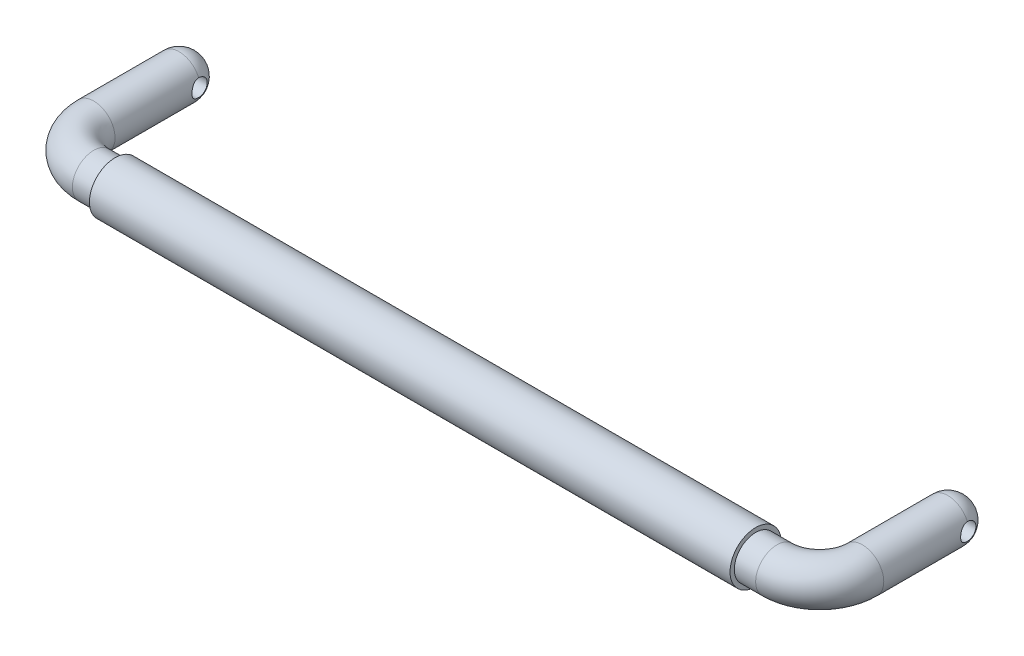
ISO-10303-21;
HEADER;
FILE_DESCRIPTION(('STEP AP214'),'2;1');
FILE_NAME('part.step','',(''),(''),'','','');
FILE_SCHEMA(('AUTOMOTIVE_DESIGN { 1 0 10303 214 1 1 1 1 }'));
ENDSEC;
DATA;
#1=APPLICATION_CONTEXT('core data for automotive mechanical design processes');
#2=APPLICATION_PROTOCOL_DEFINITION('international standard','automotive_design',2000,#1);
#3=PRODUCT_CONTEXT('',#1,'mechanical');
#4=PRODUCT('Part','Part','',(#3));
#5=PRODUCT_RELATED_PRODUCT_CATEGORY('part','',(#4));
#6=PRODUCT_DEFINITION_FORMATION('','',#4);
#7=PRODUCT_DEFINITION_CONTEXT('part definition',#1,'design');
#8=PRODUCT_DEFINITION('design','',#6,#7);
#9=PRODUCT_DEFINITION_SHAPE('','',#8);
#10=(LENGTH_UNIT() NAMED_UNIT(*) SI_UNIT(.MILLI.,.METRE.));
#11=(NAMED_UNIT(*) PLANE_ANGLE_UNIT() SI_UNIT($,.RADIAN.));
#12=(NAMED_UNIT(*) SI_UNIT($,.STERADIAN.) SOLID_ANGLE_UNIT());
#13=UNCERTAINTY_MEASURE_WITH_UNIT(LENGTH_MEASURE(1.E-05),#10,'distance_accuracy_value','');
#14=(GEOMETRIC_REPRESENTATION_CONTEXT(3) GLOBAL_UNCERTAINTY_ASSIGNED_CONTEXT((#13)) GLOBAL_UNIT_ASSIGNED_CONTEXT((#10,
#11,#12)) REPRESENTATION_CONTEXT('',''));
#15=CARTESIAN_POINT('',(0.,0.,0.));
#16=DIRECTION('',(0.,0.,1.));
#17=DIRECTION('',(1.,0.,0.));
#18=AXIS2_PLACEMENT_3D('',#15,#16,#17);
#19=CARTESIAN_POINT('',(10.,0.,30.));
#20=DIRECTION('',(1.,0.,0.));
#21=DIRECTION('',(0.,0.,1.));
#22=AXIS2_PLACEMENT_3D('',#19,#20,#21);
#23=CYLINDRICAL_SURFACE('',#22,5.);
#24=CARTESIAN_POINT('',(15.,0.,30.));
#25=DIRECTION('',(-1.,0.,0.));
#26=DIRECTION('',(0.,-1.,0.));
#27=AXIS2_PLACEMENT_3D('',#24,#25,#26);
#28=CIRCLE('',#27,5.);
#29=CARTESIAN_POINT('',(15.,-5.,30.));
#30=VERTEX_POINT('',#29);
#31=EDGE_CURVE('E9',#30,#30,#28,.F.);
#32=ORIENTED_EDGE('',*,*,#31,.F.);
#33=EDGE_LOOP('',(#32));
#34=FACE_BOUND('',#33,.T.);
#35=CARTESIAN_POINT('',(10.,0.,30.));
#36=DIRECTION('',(1.,0.,0.));
#37=DIRECTION('',(0.,-1.,0.));
#38=AXIS2_PLACEMENT_3D('',#35,#36,#37);
#39=CIRCLE('',#38,5.);
#40=CARTESIAN_POINT('',(10.,0.,35.));
#41=VERTEX_POINT('',#40);
#42=EDGE_CURVE('E97',#41,#41,#39,.T.);
#43=ORIENTED_EDGE('',*,*,#42,.T.);
#44=EDGE_LOOP('',(#43));
#45=FACE_BOUND('',#44,.T.);
#46=ADVANCED_FACE('F14',(#34,#45),#23,.T.);
#47=CARTESIAN_POINT('',(10.,0.,20.));
#48=DIRECTION('',(0.,1.,0.));
#49=DIRECTION('',(-1.,0.,0.));
#50=AXIS2_PLACEMENT_3D('',#47,#48,#49);
#51=TOROIDAL_SURFACE('',#50,10.,5.);
#52=CARTESIAN_POINT('',(0.,0.,20.));
#53=DIRECTION('',(0.,0.,1.));
#54=DIRECTION('',(0.,-1.,0.));
#55=AXIS2_PLACEMENT_3D('',#52,#53,#54);
#56=CIRCLE('',#55,5.);
#57=CARTESIAN_POINT('',(-5.,0.,20.));
#58=VERTEX_POINT('',#57);
#59=EDGE_CURVE('E99',#58,#58,#56,.T.);
#60=CARTESIAN_POINT('',(10.,0.,20.));
#61=DIRECTION('',(0.,1.,0.));
#62=DIRECTION('',(-1.,0.,0.));
#63=AXIS2_PLACEMENT_3D('',#60,#61,#62);
#64=CIRCLE('',#63,15.);
#65=EDGE_CURVE('',#58,#41,#64,.T.);
#66=ORIENTED_EDGE('',*,*,#59,.T.);
#67=ORIENTED_EDGE('',*,*,#42,.F.);
#68=ORIENTED_EDGE('',*,*,#65,.T.);
#69=ORIENTED_EDGE('',*,*,#65,.F.);
#70=EDGE_LOOP('',(#66,#68,#67,#69));
#71=FACE_BOUND('',#70,.T.);
#72=ADVANCED_FACE('F164',(#71),#51,.T.);
#73=CARTESIAN_POINT('',(0.,0.,20.));
#74=DIRECTION('',(0.,0.,-1.));
#75=DIRECTION('',(0.,1.,0.));
#76=AXIS2_PLACEMENT_3D('',#73,#74,#75);
#77=CYLINDRICAL_SURFACE('',#76,5.);
#78=ORIENTED_EDGE('',*,*,#59,.F.);
#79=EDGE_LOOP('',(#78));
#80=FACE_BOUND('',#79,.T.);
#81=CARTESIAN_POINT('',(0.,0.,0.));
#82=DIRECTION('',(0.,0.,-1.));
#83=DIRECTION('',(0.,1.,0.));
#84=AXIS2_PLACEMENT_3D('',#81,#82,#83);
#85=CIRCLE('',#84,5.);
#86=CARTESIAN_POINT('',(-4.58257569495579,2.,0.));
#87=VERTEX_POINT('',#86);
#88=CARTESIAN_POINT('',(4.58257569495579,2.,0.));
#89=VERTEX_POINT('',#88);
#90=EDGE_CURVE('E105',#87,#89,#85,.T.);
#91=ORIENTED_EDGE('',*,*,#90,.F.);
#92=CARTESIAN_POINT('',(-4.58257569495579,2.,0.));
#93=CARTESIAN_POINT('',(-4.58256464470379,2.00000798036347,0.0538058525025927));
#94=CARTESIAN_POINT('',(-4.58352306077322,1.99782891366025,0.107605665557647));
#95=CARTESIAN_POINT('',(-4.58729625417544,1.98915905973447,0.214771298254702));
#96=CARTESIAN_POINT('',(-4.59011032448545,1.98266991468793,0.268137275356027));
#97=CARTESIAN_POINT('',(-4.59749782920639,1.9654760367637,0.373846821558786));
#98=CARTESIAN_POINT('',(-4.60206430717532,1.95478796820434,0.426193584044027));
#99=CARTESIAN_POINT('',(-4.61280053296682,1.9293163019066,0.529700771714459));
#100=CARTESIAN_POINT('',(-4.61897037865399,1.9145324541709,0.580861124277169));
#101=CARTESIAN_POINT('',(-4.63959291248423,1.86426971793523,0.731935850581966));
#102=CARTESIAN_POINT('',(-4.65617449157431,1.82284489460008,0.829654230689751));
#103=CARTESIAN_POINT('',(-4.69312370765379,1.72548191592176,1.01679558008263));
#104=CARTESIAN_POINT('',(-4.71349493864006,1.66952996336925,1.10621055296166));
#105=CARTESIAN_POINT('',(-4.75700999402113,1.54131835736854,1.27926239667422));
#106=CARTESIAN_POINT('',(-4.78024245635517,1.4683691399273,1.36236721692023));
#107=CARTESIAN_POINT('',(-4.82612790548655,1.30969646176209,1.51554027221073));
#108=CARTESIAN_POINT('',(-4.84878077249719,1.22397038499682,1.58560583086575));
#109=CARTESIAN_POINT('',(-4.8920341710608,1.03800590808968,1.71340639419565));
#110=CARTESIAN_POINT('',(-4.91251824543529,0.937327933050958,1.77054480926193));
#111=CARTESIAN_POINT('',(-4.94803944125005,0.726824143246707,1.86684407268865));
#112=CARTESIAN_POINT('',(-4.96307883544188,0.617002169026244,1.90601242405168));
#113=CARTESIAN_POINT('',(-4.98538314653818,0.396967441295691,1.96334120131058));
#114=CARTESIAN_POINT('',(-4.99298922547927,0.287031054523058,1.98242695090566));
#115=CARTESIAN_POINT('',(-5.00080310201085,0.0652684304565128,2.00202847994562));
#116=CARTESIAN_POINT('',(-5.00101352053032,-0.0465571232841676,2.00255083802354));
#117=CARTESIAN_POINT('',(-4.99421960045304,-0.262233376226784,1.98551716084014));
#118=CARTESIAN_POINT('',(-4.98761985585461,-0.36617920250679,1.968974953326));
#119=CARTESIAN_POINT('',(-4.96849270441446,-0.569674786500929,1.92000657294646));
#120=CARTESIAN_POINT('',(-4.95596496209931,-0.669224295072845,1.88757950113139));
#121=CARTESIAN_POINT('',(-4.92596830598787,-0.862897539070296,1.80736370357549));
#122=CARTESIAN_POINT('',(-4.90842774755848,-0.956916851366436,1.75935075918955));
#123=CARTESIAN_POINT('',(-4.87014602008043,-1.13580746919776,1.64953541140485));
#124=CARTESIAN_POINT('',(-4.84940372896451,-1.22067554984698,1.58772817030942));
#125=CARTESIAN_POINT('',(-4.80521782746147,-1.38476339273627,1.44735581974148));
#126=CARTESIAN_POINT('',(-4.78168627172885,-1.4632477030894,1.36795752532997));
#127=CARTESIAN_POINT('',(-4.73561950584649,-1.60609926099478,1.19701990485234));
#128=CARTESIAN_POINT('',(-4.71308475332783,-1.67046007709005,1.10547507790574));
#129=CARTESIAN_POINT('',(-4.67095688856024,-1.78493657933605,0.909529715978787));
#130=CARTESIAN_POINT('',(-4.65146702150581,-1.83458932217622,0.804835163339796));
#131=CARTESIAN_POINT('',(-4.61886105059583,-1.91521298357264,0.58763847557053));
#132=CARTESIAN_POINT('',(-4.60573367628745,-1.94621696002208,0.475150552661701));
#133=CARTESIAN_POINT('',(-4.59208303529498,-1.9781058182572,0.301256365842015));
#134=CARTESIAN_POINT('',(-4.58853437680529,-1.98630505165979,0.241342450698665));
#135=CARTESIAN_POINT('',(-4.58377540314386,-1.99725282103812,0.120964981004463));
#136=CARTESIAN_POINT('',(-4.5825636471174,-2.00000471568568,0.060501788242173));
#137=CARTESIAN_POINT('',(-4.58257569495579,-2.,0.));
#138=B_SPLINE_CURVE_WITH_KNOTS('',3,(#92,#93,#94,#95,#96,#97,#98,#99,#100,#101,#102,#103,#104,
#105,#106,#107,#108,#109,#110,#111,#112,#113,#114,#115,#116,#117,#118,#119,#120,#121,#122,#123,
#124,#125,#126,#127,#128,#129,#130,#131,#132,#133,#134,#135,#136,#137),.UNSPECIFIED.,.F.,.F.,(4,
2,2,2,2,2,2,2,2,2,2,2,2,2,2,2,2,2,2,2,2,2,4),(0.,0.161354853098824,0.322648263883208,
0.483307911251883,0.643977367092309,0.964683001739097,1.28569434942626,1.62318047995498,
1.96073580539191,2.31162858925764,2.66237473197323,2.9961387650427,3.32978451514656,
3.64468915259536,3.95961161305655,4.27928176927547,4.59906421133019,4.93981874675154,
5.28072813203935,5.63144241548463,5.98153315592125,6.16300192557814,6.34435877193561),.UNSPECIFIED.);
#139=CARTESIAN_POINT('',(-4.58257569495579,-2.,0.));
#140=VERTEX_POINT('',#139);
#141=EDGE_CURVE('E29',#87,#140,#138,.T.);
#142=ORIENTED_EDGE('',*,*,#141,.T.);
#143=CARTESIAN_POINT('',(4.58257569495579,-2.,0.));
#144=VERTEX_POINT('',#143);
#145=EDGE_CURVE('E104',#144,#140,#85,.T.);
#146=ORIENTED_EDGE('',*,*,#145,.F.);
#147=CARTESIAN_POINT('',(4.58257569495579,-2.,0.));
#148=CARTESIAN_POINT('',(4.5825646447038,-2.00000798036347,0.0538058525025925));
#149=CARTESIAN_POINT('',(4.58352306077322,-1.99782891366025,0.107605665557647));
#150=CARTESIAN_POINT('',(4.58729625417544,-1.98915905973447,0.214771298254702));
#151=CARTESIAN_POINT('',(4.59011032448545,-1.98266991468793,0.268137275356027));
#152=CARTESIAN_POINT('',(4.59749782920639,-1.9654760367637,0.373846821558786));
#153=CARTESIAN_POINT('',(4.60206430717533,-1.95478796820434,0.426193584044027));
#154=CARTESIAN_POINT('',(4.61280053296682,-1.9293163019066,0.529700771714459));
#155=CARTESIAN_POINT('',(4.61897037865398,-1.9145324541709,0.580861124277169));
#156=CARTESIAN_POINT('',(4.63959291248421,-1.86426971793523,0.731935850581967));
#157=CARTESIAN_POINT('',(4.65617449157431,-1.82284489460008,0.82965423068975));
#158=CARTESIAN_POINT('',(4.6931237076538,-1.72548191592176,1.01679558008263));
#159=CARTESIAN_POINT('',(4.71349493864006,-1.66952996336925,1.10621055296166));
#160=CARTESIAN_POINT('',(4.75700999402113,-1.54131835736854,1.27926239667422));
#161=CARTESIAN_POINT('',(4.78024245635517,-1.4683691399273,1.36236721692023));
#162=CARTESIAN_POINT('',(4.82612790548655,-1.30969646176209,1.51554027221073));
#163=CARTESIAN_POINT('',(4.84878077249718,-1.22397038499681,1.58560583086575));
#164=CARTESIAN_POINT('',(4.89203417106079,-1.03800590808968,1.71340639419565));
#165=CARTESIAN_POINT('',(4.91251824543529,-0.937327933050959,1.77054480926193));
#166=CARTESIAN_POINT('',(4.94803944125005,-0.726824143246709,1.86684407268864));
#167=CARTESIAN_POINT('',(4.96307883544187,-0.617002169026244,1.90601242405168));
#168=CARTESIAN_POINT('',(4.98538314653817,-0.39696744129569,1.96334120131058));
#169=CARTESIAN_POINT('',(4.99298922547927,-0.287031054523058,1.98242695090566));
#170=CARTESIAN_POINT('',(5.00080310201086,-0.065268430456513,2.00202847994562));
#171=CARTESIAN_POINT('',(5.00101352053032,0.0465571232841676,2.00255083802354));
#172=CARTESIAN_POINT('',(4.99421960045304,0.262233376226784,1.98551716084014));
#173=CARTESIAN_POINT('',(4.98761985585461,0.36617920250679,1.968974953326));
#174=CARTESIAN_POINT('',(4.96849270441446,0.569674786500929,1.92000657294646));
#175=CARTESIAN_POINT('',(4.95596496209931,0.669224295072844,1.88757950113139));
#176=CARTESIAN_POINT('',(4.92596830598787,0.862897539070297,1.80736370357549));
#177=CARTESIAN_POINT('',(4.90842774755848,0.956916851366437,1.75935075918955));
#178=CARTESIAN_POINT('',(4.87014602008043,1.13580746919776,1.64953541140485));
#179=CARTESIAN_POINT('',(4.8494037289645,1.22067554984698,1.58772817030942));
#180=CARTESIAN_POINT('',(4.80521782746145,1.38476339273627,1.44735581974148));
#181=CARTESIAN_POINT('',(4.78168627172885,1.4632477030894,1.36795752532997));
#182=CARTESIAN_POINT('',(4.73561950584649,1.60609926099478,1.19701990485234));
#183=CARTESIAN_POINT('',(4.71308475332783,1.67046007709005,1.10547507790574));
#184=CARTESIAN_POINT('',(4.67095688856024,1.78493657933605,0.909529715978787));
#185=CARTESIAN_POINT('',(4.65146702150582,1.83458932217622,0.804835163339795));
#186=CARTESIAN_POINT('',(4.61886105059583,1.91521298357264,0.587638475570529));
#187=CARTESIAN_POINT('',(4.60573367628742,1.94621696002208,0.475150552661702));
#188=CARTESIAN_POINT('',(4.59208303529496,1.9781058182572,0.301256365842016));
#189=CARTESIAN_POINT('',(4.58853437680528,1.98630505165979,0.241342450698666));
#190=CARTESIAN_POINT('',(4.58377540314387,1.99725282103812,0.120964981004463));
#191=CARTESIAN_POINT('',(4.58256364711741,2.00000471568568,0.0605017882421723));
#192=CARTESIAN_POINT('',(4.58257569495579,2.,0.));
#193=B_SPLINE_CURVE_WITH_KNOTS('',3,(#147,#148,#149,#150,#151,#152,#153,#154,#155,#156,#157,
#158,#159,#160,#161,#162,#163,#164,#165,#166,#167,#168,#169,#170,#171,#172,#173,#174,#175,#176,
#177,#178,#179,#180,#181,#182,#183,#184,#185,#186,#187,#188,#189,#190,#191,#192),.UNSPECIFIED.,
.F.,.F.,(4,2,2,2,2,2,2,2,2,2,2,2,2,2,2,2,2,2,2,2,2,2,4),(0.,0.161354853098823,0.322648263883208,
0.483307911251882,0.643977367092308,0.964683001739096,1.28569434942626,1.62318047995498,
1.96073580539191,2.31162858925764,2.66237473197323,2.9961387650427,3.32978451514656,
3.64468915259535,3.95961161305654,4.27928176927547,4.59906421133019,4.93981874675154,
5.28072813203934,5.63144241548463,5.98153315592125,6.16300192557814,6.34435877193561),.UNSPECIFIED.);
#194=EDGE_CURVE('E36',#144,#89,#193,.T.);
#195=ORIENTED_EDGE('',*,*,#194,.T.);
#196=EDGE_LOOP('',(#91,#142,#146,#195));
#197=FACE_BOUND('',#196,.T.);
#198=ADVANCED_FACE('F117',(#80,#197),#77,.T.);
#199=CARTESIAN_POINT('',(0.,0.,0.));
#200=DIRECTION('',(-1.,0.,0.));
#201=DIRECTION('',(0.,-1.,0.));
#202=AXIS2_PLACEMENT_3D('',#199,#200,#201);
#203=SPHERICAL_SURFACE('',#202,5.);
#204=CARTESIAN_POINT('',(4.58257569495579,0.,0.));
#205=DIRECTION('',(-1.,0.,0.));
#206=DIRECTION('',(0.,-1.,0.));
#207=AXIS2_PLACEMENT_3D('',#204,#205,#206);
#208=CIRCLE('',#207,2.);
#209=EDGE_CURVE('E115',#144,#89,#208,.F.);
#210=ORIENTED_EDGE('',*,*,#209,.F.);
#211=ORIENTED_EDGE('',*,*,#145,.T.);
#212=CARTESIAN_POINT('',(-4.58257569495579,0.,0.));
#213=DIRECTION('',(1.,0.,0.));
#214=DIRECTION('',(0.,1.,0.));
#215=AXIS2_PLACEMENT_3D('',#212,#213,#214);
#216=CIRCLE('',#215,2.);
#217=EDGE_CURVE('E147',#87,#140,#216,.F.);
#218=ORIENTED_EDGE('',*,*,#217,.F.);
#219=ORIENTED_EDGE('',*,*,#90,.T.);
#220=EDGE_LOOP('',(#210,#211,#218,#219));
#221=FACE_BOUND('',#220,.T.);
#222=ADVANCED_FACE('F153',(#221),#203,.T.);
#223=CARTESIAN_POINT('',(-10.,0.,0.));
#224=DIRECTION('',(1.,0.,0.));
#225=DIRECTION('',(0.,1.,0.));
#226=AXIS2_PLACEMENT_3D('',#223,#224,#225);
#227=CYLINDRICAL_SURFACE('',#226,2.);
#228=ORIENTED_EDGE('',*,*,#217,.T.);
#229=ORIENTED_EDGE('',*,*,#141,.F.);
#230=EDGE_LOOP('',(#228,#229));
#231=FACE_BOUND('',#230,.T.);
#232=ORIENTED_EDGE('',*,*,#209,.T.);
#233=ORIENTED_EDGE('',*,*,#194,.F.);
#234=EDGE_LOOP('',(#232,#233));
#235=FACE_BOUND('',#234,.T.);
#236=ADVANCED_FACE('F126',(#231,#235),#227,.F.);
#237=CARTESIAN_POINT('',(15.,0.,30.));
#238=DIRECTION('',(-1.,0.,0.));
#239=DIRECTION('',(0.,-1.,0.));
#240=AXIS2_PLACEMENT_3D('',#237,#238,#239);
#241=PLANE('',#240);
#242=ORIENTED_EDGE('',*,*,#31,.T.);
#243=EDGE_LOOP('',(#242));
#244=FACE_BOUND('',#243,.T.);
#245=CARTESIAN_POINT('',(15.,0.,30.));
#246=DIRECTION('',(-1.,0.,0.));
#247=DIRECTION('',(0.,-1.,0.));
#248=AXIS2_PLACEMENT_3D('',#245,#246,#247);
#249=CIRCLE('',#248,6.);
#250=CARTESIAN_POINT('',(15.,-6.,30.));
#251=VERTEX_POINT('',#250);
#252=EDGE_CURVE('E72',#251,#251,#249,.T.);
#253=ORIENTED_EDGE('',*,*,#252,.T.);
#254=EDGE_LOOP('',(#253));
#255=FACE_BOUND('',#254,.T.);
#256=ADVANCED_FACE('F127',(#244,#255),#241,.T.);
#257=CARTESIAN_POINT('',(15.,0.,30.));
#258=DIRECTION('',(-1.,0.,0.));
#259=DIRECTION('',(0.,-1.,0.));
#260=AXIS2_PLACEMENT_3D('',#257,#258,#259);
#261=CYLINDRICAL_SURFACE('',#260,6.);
#262=ORIENTED_EDGE('',*,*,#252,.F.);
#263=EDGE_LOOP('',(#262));
#264=FACE_BOUND('',#263,.T.);
#265=CARTESIAN_POINT('',(165.,0.,30.));
#266=DIRECTION('',(-1.,0.,0.));
#267=DIRECTION('',(0.,-1.,0.));
#268=AXIS2_PLACEMENT_3D('',#265,#266,#267);
#269=CIRCLE('',#268,6.);
#270=CARTESIAN_POINT('',(165.,-6.,30.));
#271=VERTEX_POINT('',#270);
#272=EDGE_CURVE('E271',#271,#271,#269,.T.);
#273=ORIENTED_EDGE('',*,*,#272,.T.);
#274=EDGE_LOOP('',(#273));
#275=FACE_BOUND('',#274,.T.);
#276=ADVANCED_FACE('F161',(#264,#275),#261,.T.);
#277=CARTESIAN_POINT('',(165.,0.,36.));
#278=DIRECTION('',(1.,0.,0.));
#279=DIRECTION('',(0.,1.,0.));
#280=AXIS2_PLACEMENT_3D('',#277,#278,#279);
#281=PLANE('',#280);
#282=CARTESIAN_POINT('',(165.,0.,30.));
#283=DIRECTION('',(1.,0.,0.));
#284=DIRECTION('',(0.,1.,0.));
#285=AXIS2_PLACEMENT_3D('',#282,#283,#284);
#286=CIRCLE('',#285,5.);
#287=CARTESIAN_POINT('',(165.,5.,30.));
#288=VERTEX_POINT('',#287);
#289=EDGE_CURVE('E23',#288,#288,#286,.F.);
#290=ORIENTED_EDGE('',*,*,#289,.T.);
#291=EDGE_LOOP('',(#290));
#292=FACE_BOUND('',#291,.T.);
#293=ORIENTED_EDGE('',*,*,#272,.F.);
#294=EDGE_LOOP('',(#293));
#295=FACE_BOUND('',#294,.T.);
#296=ADVANCED_FACE('F86',(#292,#295),#281,.T.);
#297=CARTESIAN_POINT('',(180.,0.,0.));
#298=DIRECTION('',(1.,0.,0.));
#299=DIRECTION('',(0.,-1.,0.));
#300=AXIS2_PLACEMENT_3D('',#297,#298,#299);
#301=SPHERICAL_SURFACE('',#300,5.);
#302=CARTESIAN_POINT('',(184.582575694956,0.,0.));
#303=DIRECTION('',(-1.,0.,0.));
#304=DIRECTION('',(0.,-1.,0.));
#305=AXIS2_PLACEMENT_3D('',#302,#303,#304);
#306=CIRCLE('',#305,2.);
#307=CARTESIAN_POINT('',(184.582575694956,-2.,0.));
#308=VERTEX_POINT('',#307);
#309=CARTESIAN_POINT('',(184.582575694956,2.,0.));
#310=VERTEX_POINT('',#309);
#311=EDGE_CURVE('E63',#308,#310,#306,.F.);
#312=ORIENTED_EDGE('',*,*,#311,.F.);
#313=CARTESIAN_POINT('',(180.,0.,0.));
#314=DIRECTION('',(0.,0.,-1.));
#315=DIRECTION('',(0.,-1.,0.));
#316=AXIS2_PLACEMENT_3D('',#313,#314,#315);
#317=CIRCLE('',#316,5.);
#318=CARTESIAN_POINT('',(175.417424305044,-2.,0.));
#319=VERTEX_POINT('',#318);
#320=EDGE_CURVE('E70',#308,#319,#317,.T.);
#321=ORIENTED_EDGE('',*,*,#320,.T.);
#322=CARTESIAN_POINT('',(175.417424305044,0.,0.));
#323=DIRECTION('',(1.,0.,0.));
#324=DIRECTION('',(0.,1.,0.));
#325=AXIS2_PLACEMENT_3D('',#322,#323,#324);
#326=CIRCLE('',#325,2.);
#327=CARTESIAN_POINT('',(175.417424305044,2.,0.));
#328=VERTEX_POINT('',#327);
#329=EDGE_CURVE('E55',#328,#319,#326,.F.);
#330=ORIENTED_EDGE('',*,*,#329,.F.);
#331=EDGE_CURVE('E64',#328,#310,#317,.T.);
#332=ORIENTED_EDGE('',*,*,#331,.T.);
#333=EDGE_LOOP('',(#312,#321,#330,#332));
#334=FACE_BOUND('',#333,.T.);
#335=ADVANCED_FACE('F75',(#334),#301,.T.);
#336=CARTESIAN_POINT('',(184.582575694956,2.,0.));
#337=CARTESIAN_POINT('',(184.582564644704,2.00000798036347,0.0538058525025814));
#338=CARTESIAN_POINT('',(184.583523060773,1.99782891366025,0.107605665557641));
#339=CARTESIAN_POINT('',(184.587296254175,1.98915905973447,0.214771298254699));
#340=CARTESIAN_POINT('',(184.590110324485,1.98266991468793,0.268137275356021));
#341=CARTESIAN_POINT('',(184.597497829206,1.9654760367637,0.373846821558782));
#342=CARTESIAN_POINT('',(184.602064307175,1.95478796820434,0.426193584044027));
#343=CARTESIAN_POINT('',(184.612800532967,1.92931630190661,0.529700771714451));
#344=CARTESIAN_POINT('',(184.618970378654,1.91453245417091,0.580861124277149));
#345=CARTESIAN_POINT('',(184.639592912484,1.86426971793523,0.73193585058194));
#346=CARTESIAN_POINT('',(184.656174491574,1.82284489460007,0.829654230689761));
#347=CARTESIAN_POINT('',(184.693123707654,1.72548191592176,1.01679558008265));
#348=CARTESIAN_POINT('',(184.71349493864,1.66952996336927,1.10621055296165));
#349=CARTESIAN_POINT('',(184.757009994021,1.54131835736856,1.27926239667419));
#350=CARTESIAN_POINT('',(184.780242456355,1.4683691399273,1.36236721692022));
#351=CARTESIAN_POINT('',(184.826127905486,1.30969646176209,1.51554027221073));
#352=CARTESIAN_POINT('',(184.848780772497,1.22397038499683,1.58560583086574));
#353=CARTESIAN_POINT('',(184.892034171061,1.0380059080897,1.71340639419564));
#354=CARTESIAN_POINT('',(184.912518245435,0.937327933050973,1.77054480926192));
#355=CARTESIAN_POINT('',(184.94803944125,0.726824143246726,1.86684407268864));
#356=CARTESIAN_POINT('',(184.963078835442,0.617002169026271,1.90601242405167));
#357=CARTESIAN_POINT('',(184.985383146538,0.396967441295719,1.96334120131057));
#358=CARTESIAN_POINT('',(184.992989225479,0.287031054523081,1.98242695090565));
#359=CARTESIAN_POINT('',(185.000803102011,0.0652684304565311,2.00202847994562));
#360=CARTESIAN_POINT('',(185.001013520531,-0.0465571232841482,2.00255083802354));
#361=CARTESIAN_POINT('',(184.994219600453,-0.262233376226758,1.98551716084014));
#362=CARTESIAN_POINT('',(184.987619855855,-0.366179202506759,1.968974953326));
#363=CARTESIAN_POINT('',(184.968492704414,-0.569674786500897,1.92000657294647));
#364=CARTESIAN_POINT('',(184.955964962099,-0.669224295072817,1.8875795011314));
#365=CARTESIAN_POINT('',(184.925968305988,-0.862897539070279,1.8073637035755));
#366=CARTESIAN_POINT('',(184.908427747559,-0.956916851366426,1.75935075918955));
#367=CARTESIAN_POINT('',(184.87014602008,-1.13580746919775,1.64953541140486));
#368=CARTESIAN_POINT('',(184.849403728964,-1.22067554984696,1.58772817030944));
#369=CARTESIAN_POINT('',(184.805217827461,-1.38476339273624,1.44735581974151));
#370=CARTESIAN_POINT('',(184.781686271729,-1.46324770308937,1.36795752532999));
#371=CARTESIAN_POINT('',(184.735619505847,-1.60609926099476,1.19701990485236));
#372=CARTESIAN_POINT('',(184.713084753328,-1.67046007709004,1.10547507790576));
#373=CARTESIAN_POINT('',(184.67095688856,-1.78493657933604,0.90952971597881));
#374=CARTESIAN_POINT('',(184.651467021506,-1.83458932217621,0.804835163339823));
#375=CARTESIAN_POINT('',(184.618861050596,-1.91521298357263,0.587638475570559));
#376=CARTESIAN_POINT('',(184.605733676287,-1.94621696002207,0.475150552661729));
#377=CARTESIAN_POINT('',(184.592083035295,-1.9781058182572,0.301256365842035));
#378=CARTESIAN_POINT('',(184.588534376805,-1.98630505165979,0.24134245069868));
#379=CARTESIAN_POINT('',(184.583775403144,-1.99725282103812,0.120964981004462));
#380=CARTESIAN_POINT('',(184.582563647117,-2.00000471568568,0.0605017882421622));
#381=CARTESIAN_POINT('',(184.582575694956,-2.,0.));
#382=B_SPLINE_CURVE_WITH_KNOTS('',3,(#336,#337,#338,#339,#340,#341,#342,#343,#344,#345,#346,
#347,#348,#349,#350,#351,#352,#353,#354,#355,#356,#357,#358,#359,#360,#361,#362,#363,#364,#365,
#366,#367,#368,#369,#370,#371,#372,#373,#374,#375,#376,#377,#378,#379,#380,#381),.UNSPECIFIED.,
.F.,.F.,(4,2,2,2,2,2,2,2,2,2,2,2,2,2,2,2,2,2,2,2,2,2,4),(0.,0.16135485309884,0.322648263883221,
0.483307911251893,0.643977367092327,0.964683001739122,1.28569434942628,1.62318047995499,
1.96073580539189,2.31162858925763,2.66237473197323,2.9961387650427,3.32978451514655,
3.64468915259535,3.95961161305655,4.27928176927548,4.59906421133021,4.93981874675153,
5.28072813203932,5.63144241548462,5.98153315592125,6.16300192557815,6.34435877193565),.UNSPECIFIED.);
#383=EDGE_CURVE('E71',#310,#308,#382,.T.);
#384=ORIENTED_EDGE('',*,*,#383,.T.);
#385=ORIENTED_EDGE('',*,*,#311,.T.);
#386=EDGE_LOOP('',(#384,#385));
#387=FACE_BOUND('',#386,.T.);
#388=CARTESIAN_POINT('',(175.417424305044,-2.,0.));
#389=CARTESIAN_POINT('',(175.417435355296,-2.00000798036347,0.0538058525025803));
#390=CARTESIAN_POINT('',(175.416476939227,-1.99782891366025,0.107605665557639));
#391=CARTESIAN_POINT('',(175.412703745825,-1.98915905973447,0.214771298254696));
#392=CARTESIAN_POINT('',(175.409889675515,-1.98266991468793,0.268137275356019));
#393=CARTESIAN_POINT('',(175.402502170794,-1.9654760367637,0.373846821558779));
#394=CARTESIAN_POINT('',(175.397935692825,-1.95478796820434,0.426193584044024));
#395=CARTESIAN_POINT('',(175.387199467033,-1.92931630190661,0.529700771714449));
#396=CARTESIAN_POINT('',(175.381029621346,-1.91453245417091,0.580861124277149));
#397=CARTESIAN_POINT('',(175.360407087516,-1.86426971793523,0.731935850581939));
#398=CARTESIAN_POINT('',(175.343825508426,-1.82284489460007,0.829654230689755));
#399=CARTESIAN_POINT('',(175.306876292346,-1.72548191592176,1.01679558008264));
#400=CARTESIAN_POINT('',(175.28650506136,-1.66952996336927,1.10621055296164));
#401=CARTESIAN_POINT('',(175.242990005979,-1.54131835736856,1.2792623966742));
#402=CARTESIAN_POINT('',(175.219757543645,-1.4683691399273,1.36236721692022));
#403=CARTESIAN_POINT('',(175.173872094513,-1.30969646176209,1.51554027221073));
#404=CARTESIAN_POINT('',(175.151219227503,-1.22397038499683,1.58560583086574));
#405=CARTESIAN_POINT('',(175.107965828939,-1.0380059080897,1.71340639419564));
#406=CARTESIAN_POINT('',(175.087481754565,-0.937327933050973,1.77054480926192));
#407=CARTESIAN_POINT('',(175.05196055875,-0.726824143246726,1.86684407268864));
#408=CARTESIAN_POINT('',(175.036921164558,-0.61700216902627,1.90601242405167));
#409=CARTESIAN_POINT('',(175.014616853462,-0.396967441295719,1.96334120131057));
#410=CARTESIAN_POINT('',(175.007010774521,-0.287031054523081,1.98242695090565));
#411=CARTESIAN_POINT('',(174.999196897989,-0.0652684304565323,2.00202847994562));
#412=CARTESIAN_POINT('',(174.998986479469,0.0465571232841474,2.00255083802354));
#413=CARTESIAN_POINT('',(175.005780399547,0.262233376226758,1.98551716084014));
#414=CARTESIAN_POINT('',(175.012380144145,0.366179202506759,1.968974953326));
#415=CARTESIAN_POINT('',(175.031507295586,0.569674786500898,1.92000657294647));
#416=CARTESIAN_POINT('',(175.044035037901,0.669224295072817,1.8875795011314));
#417=CARTESIAN_POINT('',(175.074031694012,0.862897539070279,1.8073637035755));
#418=CARTESIAN_POINT('',(175.091572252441,0.956916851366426,1.75935075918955));
#419=CARTESIAN_POINT('',(175.12985397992,1.13580746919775,1.64953541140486));
#420=CARTESIAN_POINT('',(175.150596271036,1.22067554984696,1.58772817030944));
#421=CARTESIAN_POINT('',(175.194782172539,1.38476339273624,1.44735581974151));
#422=CARTESIAN_POINT('',(175.218313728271,1.46324770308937,1.36795752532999));
#423=CARTESIAN_POINT('',(175.264380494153,1.60609926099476,1.19701990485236));
#424=CARTESIAN_POINT('',(175.286915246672,1.67046007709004,1.10547507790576));
#425=CARTESIAN_POINT('',(175.32904311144,1.78493657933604,0.90952971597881));
#426=CARTESIAN_POINT('',(175.348532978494,1.83458932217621,0.804835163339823));
#427=CARTESIAN_POINT('',(175.381138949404,1.91521298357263,0.587638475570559));
#428=CARTESIAN_POINT('',(175.394266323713,1.94621696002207,0.475150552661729));
#429=CARTESIAN_POINT('',(175.407916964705,1.9781058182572,0.301256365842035));
#430=CARTESIAN_POINT('',(175.411465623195,1.98630505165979,0.24134245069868));
#431=CARTESIAN_POINT('',(175.416224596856,1.99725282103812,0.120964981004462));
#432=CARTESIAN_POINT('',(175.417436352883,2.00000471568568,0.0605017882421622));
#433=CARTESIAN_POINT('',(175.417424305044,2.,0.));
#434=B_SPLINE_CURVE_WITH_KNOTS('',3,(#388,#389,#390,#391,#392,#393,#394,#395,#396,#397,#398,
#399,#400,#401,#402,#403,#404,#405,#406,#407,#408,#409,#410,#411,#412,#413,#414,#415,#416,#417,
#418,#419,#420,#421,#422,#423,#424,#425,#426,#427,#428,#429,#430,#431,#432,#433),.UNSPECIFIED.,
.F.,.F.,(4,2,2,2,2,2,2,2,2,2,2,2,2,2,2,2,2,2,2,2,2,2,4),(0.,0.161354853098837,0.322648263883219,
0.483307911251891,0.643977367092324,0.964683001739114,1.28569434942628,1.62318047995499,
1.9607358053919,2.31162858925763,2.66237473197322,2.99613876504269,3.32978451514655,
3.64468915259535,3.95961161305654,4.27928176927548,4.59906421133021,4.93981874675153,
5.28072813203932,5.63144241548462,5.98153315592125,6.16300192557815,6.34435877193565),.UNSPECIFIED.);
#435=EDGE_CURVE('E58',#319,#328,#434,.T.);
#436=ORIENTED_EDGE('',*,*,#435,.T.);
#437=ORIENTED_EDGE('',*,*,#329,.T.);
#438=EDGE_LOOP('',(#436,#437));
#439=FACE_BOUND('',#438,.T.);
#440=ADVANCED_FACE('F57',(#387,#439),#227,.F.);
#441=CARTESIAN_POINT('',(180.,0.,20.));
#442=DIRECTION('',(0.,0.,-1.));
#443=DIRECTION('',(0.,1.,0.));
#444=AXIS2_PLACEMENT_3D('',#441,#442,#443);
#445=CYLINDRICAL_SURFACE('',#444,5.);
#446=ORIENTED_EDGE('',*,*,#383,.F.);
#447=ORIENTED_EDGE('',*,*,#331,.F.);
#448=ORIENTED_EDGE('',*,*,#435,.F.);
#449=ORIENTED_EDGE('',*,*,#320,.F.);
#450=EDGE_LOOP('',(#446,#447,#448,#449));
#451=FACE_BOUND('',#450,.T.);
#452=CARTESIAN_POINT('',(180.,0.,20.));
#453=DIRECTION('',(0.,0.,-1.));
#454=DIRECTION('',(0.,-1.,0.));
#455=AXIS2_PLACEMENT_3D('',#452,#453,#454);
#456=CIRCLE('',#455,5.);
#457=CARTESIAN_POINT('',(185.,0.,20.));
#458=VERTEX_POINT('',#457);
#459=EDGE_CURVE('E76',#458,#458,#456,.T.);
#460=ORIENTED_EDGE('',*,*,#459,.T.);
#461=EDGE_LOOP('',(#460));
#462=FACE_BOUND('',#461,.T.);
#463=ADVANCED_FACE('F16',(#451,#462),#445,.T.);
#464=CARTESIAN_POINT('',(170.,0.,20.));
#465=DIRECTION('',(0.,1.,0.));
#466=DIRECTION('',(-1.,0.,0.));
#467=AXIS2_PLACEMENT_3D('',#464,#465,#466);
#468=TOROIDAL_SURFACE('',#467,10.,5.);
#469=CARTESIAN_POINT('',(170.,0.,30.));
#470=DIRECTION('',(1.,0.,0.));
#471=DIRECTION('',(0.,-1.,0.));
#472=AXIS2_PLACEMENT_3D('',#469,#470,#471);
#473=CIRCLE('',#472,5.);
#474=CARTESIAN_POINT('',(170.,0.,35.));
#475=VERTEX_POINT('',#474);
#476=EDGE_CURVE('E79',#475,#475,#473,.T.);
#477=CARTESIAN_POINT('',(170.,0.,20.));
#478=DIRECTION('',(0.,1.,0.));
#479=DIRECTION('',(-1.,0.,0.));
#480=AXIS2_PLACEMENT_3D('',#477,#478,#479);
#481=CIRCLE('',#480,15.);
#482=EDGE_CURVE('',#475,#458,#481,.T.);
#483=ORIENTED_EDGE('',*,*,#476,.T.);
#484=ORIENTED_EDGE('',*,*,#459,.F.);
#485=ORIENTED_EDGE('',*,*,#482,.T.);
#486=ORIENTED_EDGE('',*,*,#482,.F.);
#487=EDGE_LOOP('',(#483,#485,#484,#486));
#488=FACE_BOUND('',#487,.T.);
#489=ADVANCED_FACE('F92',(#488),#468,.T.);
#490=ORIENTED_EDGE('',*,*,#289,.F.);
#491=EDGE_LOOP('',(#490));
#492=FACE_BOUND('',#491,.T.);
#493=ORIENTED_EDGE('',*,*,#476,.F.);
#494=EDGE_LOOP('',(#493));
#495=FACE_BOUND('',#494,.T.);
#496=ADVANCED_FACE('F89',(#492,#495),#23,.T.);
#497=CLOSED_SHELL('',(#46,#72,#198,#222,#236,#256,#276,#296,#335,#440,#463,#489,#496));
#498=MANIFOLD_SOLID_BREP('B1',#497);
#499=ADVANCED_BREP_SHAPE_REPRESENTATION('',(#18,#498),#14);
#500=SHAPE_DEFINITION_REPRESENTATION(#9,#499);
ENDSEC;
END-ISO-10303-21;
